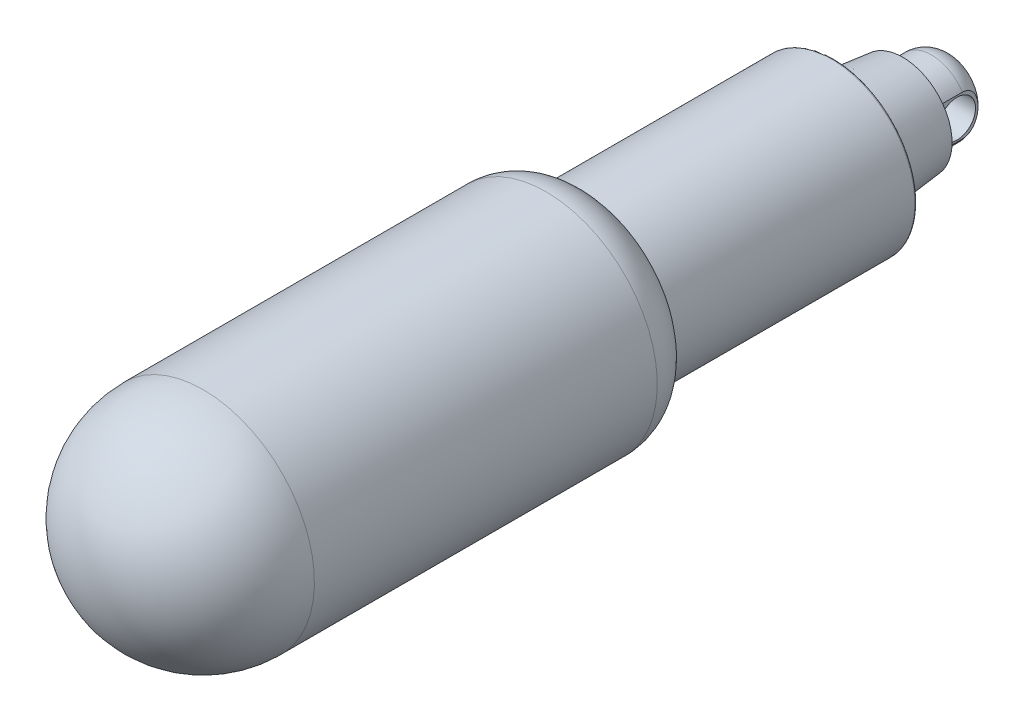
ISO-10303-21;
HEADER;
FILE_DESCRIPTION(('STEP AP214'),'2;1');
FILE_NAME('part.step','',(''),(''),'','','');
FILE_SCHEMA(('AUTOMOTIVE_DESIGN { 1 0 10303 214 1 1 1 1 }'));
ENDSEC;
DATA;
#1=APPLICATION_CONTEXT('core data for automotive mechanical design processes');
#2=APPLICATION_PROTOCOL_DEFINITION('international standard','automotive_design',2000,#1);
#3=PRODUCT_CONTEXT('',#1,'mechanical');
#4=PRODUCT('Part','Part','',(#3));
#5=PRODUCT_RELATED_PRODUCT_CATEGORY('part','',(#4));
#6=PRODUCT_DEFINITION_FORMATION('','',#4);
#7=PRODUCT_DEFINITION_CONTEXT('part definition',#1,'design');
#8=PRODUCT_DEFINITION('design','',#6,#7);
#9=PRODUCT_DEFINITION_SHAPE('','',#8);
#10=(LENGTH_UNIT() NAMED_UNIT(*) SI_UNIT(.MILLI.,.METRE.));
#11=(NAMED_UNIT(*) PLANE_ANGLE_UNIT() SI_UNIT($,.RADIAN.));
#12=(NAMED_UNIT(*) SI_UNIT($,.STERADIAN.) SOLID_ANGLE_UNIT());
#13=UNCERTAINTY_MEASURE_WITH_UNIT(LENGTH_MEASURE(1.E-05),#10,'distance_accuracy_value','');
#14=(GEOMETRIC_REPRESENTATION_CONTEXT(3) GLOBAL_UNCERTAINTY_ASSIGNED_CONTEXT((#13)) GLOBAL_UNIT_ASSIGNED_CONTEXT((#10,
#11,#12)) REPRESENTATION_CONTEXT('',''));
#15=CARTESIAN_POINT('',(0.,0.,0.));
#16=DIRECTION('',(0.,0.,1.));
#17=DIRECTION('',(1.,0.,0.));
#18=AXIS2_PLACEMENT_3D('',#15,#16,#17);
#19=CARTESIAN_POINT('',(0.,-0.75,-3.0833333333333));
#20=DIRECTION('',(0.,0.,-1.));
#21=DIRECTION('',(0.,1.,0.));
#22=AXIS2_PLACEMENT_3D('',#19,#20,#21);
#23=PLANE('',#22);
#24=CARTESIAN_POINT('',(0.,0.,-3.0833333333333));
#25=DIRECTION('',(0.,0.,1.));
#26=DIRECTION('',(-1.,0.,0.));
#27=AXIS2_PLACEMENT_3D('',#24,#25,#26);
#28=CIRCLE('',#27,1.5);
#29=CARTESIAN_POINT('',(-1.5,0.,-3.0833333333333));
#30=VERTEX_POINT('',#29);
#31=CARTESIAN_POINT('',(0.,-1.5,-3.0833333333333));
#32=VERTEX_POINT('',#31);
#33=EDGE_CURVE('E70',#30,#32,#28,.T.);
#34=ORIENTED_EDGE('',*,*,#33,.F.);
#35=CARTESIAN_POINT('',(0.,0.,-3.0833333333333));
#36=DIRECTION('',(0.,0.,1.));
#37=DIRECTION('',(1.,0.,0.));
#38=AXIS2_PLACEMENT_3D('',#35,#36,#37);
#39=CIRCLE('',#38,1.49999999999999);
#40=CARTESIAN_POINT('',(1.5,0.,-3.0833333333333));
#41=VERTEX_POINT('',#40);
#42=EDGE_CURVE('E484',#41,#30,#39,.T.);
#43=ORIENTED_EDGE('',*,*,#42,.F.);
#44=CARTESIAN_POINT('',(0.,0.,-3.0833333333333));
#45=DIRECTION('',(0.,0.,1.));
#46=DIRECTION('',(0.,-1.,0.));
#47=AXIS2_PLACEMENT_3D('',#44,#45,#46);
#48=CIRCLE('',#47,1.49999999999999);
#49=EDGE_CURVE('E77',#32,#41,#48,.T.);
#50=ORIENTED_EDGE('',*,*,#49,.F.);
#51=EDGE_LOOP('',(#34,#43,#50));
#52=FACE_BOUND('',#51,.T.);
#53=ADVANCED_FACE('F14',(#52),#23,.T.);
#54=CARTESIAN_POINT('',(-12.,0.,0.));
#55=DIRECTION('',(-1.,0.,0.));
#56=DIRECTION('',(0.,-1.,0.));
#57=AXIS2_PLACEMENT_3D('',#54,#55,#56);
#58=CYLINDRICAL_SURFACE('',#57,2.);
#59=CARTESIAN_POINT('',(-3.35,0.,0.));
#60=DIRECTION('',(-1.,0.,0.));
#61=DIRECTION('',(0.,-1.,0.));
#62=AXIS2_PLACEMENT_3D('',#59,#60,#61);
#63=CIRCLE('',#62,2.);
#64=CARTESIAN_POINT('',(-3.35,-2.,0.));
#65=VERTEX_POINT('',#64);
#66=EDGE_CURVE('E230',#65,#65,#63,.T.);
#67=ORIENTED_EDGE('',*,*,#66,.T.);
#68=EDGE_LOOP('',(#67));
#69=FACE_BOUND('',#68,.T.);
#70=CARTESIAN_POINT('',(3.35,0.,0.));
#71=DIRECTION('',(-1.,0.,0.));
#72=DIRECTION('',(0.,-1.,0.));
#73=AXIS2_PLACEMENT_3D('',#70,#71,#72);
#74=CIRCLE('',#73,2.);
#75=CARTESIAN_POINT('',(3.35,-2.,0.));
#76=VERTEX_POINT('',#75);
#77=EDGE_CURVE('E480',#76,#76,#74,.F.);
#78=ORIENTED_EDGE('',*,*,#77,.T.);
#79=EDGE_LOOP('',(#78));
#80=FACE_BOUND('',#79,.T.);
#81=ADVANCED_FACE('F251',(#69,#80),#58,.F.);
#82=CARTESIAN_POINT('',(1.5,0.,-0.583333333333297));
#83=DIRECTION('',(0.,1.,0.));
#84=DIRECTION('',(1.,0.,0.));
#85=AXIS2_PLACEMENT_3D('',#82,#83,#84);
#86=CIRCLE('',#85,2.5);
#87=TRIMMED_CURVE('',#86,(PARAMETER_VALUE(-2.21429743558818)),
(PARAMETER_VALUE(2.21429743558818)),.T.,.PARAMETER.);
#88=CARTESIAN_POINT('',(0.,0.,-0.583333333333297));
#89=DIRECTION('',(0.,0.,1.));
#90=AXIS1_PLACEMENT('',#88,#89);
#91=SURFACE_OF_REVOLUTION('',#87,#90);
#92=ORIENTED_EDGE('',*,*,#49,.T.);
#93=ORIENTED_EDGE('',*,*,#42,.T.);
#94=ORIENTED_EDGE('',*,*,#33,.T.);
#95=EDGE_LOOP('',(#92,#93,#94));
#96=FACE_BOUND('',#95,.T.);
#97=CARTESIAN_POINT('',(0.,0.,-0.583333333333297));
#98=DIRECTION('',(0.,0.,-1.));
#99=DIRECTION('',(-1.,0.,0.));
#100=AXIS2_PLACEMENT_3D('',#97,#98,#99);
#101=CIRCLE('',#100,4.);
#102=CARTESIAN_POINT('',(3.35,2.1857492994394,-0.583333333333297));
#103=VERTEX_POINT('',#102);
#104=CARTESIAN_POINT('',(-3.35,2.1857492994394,-0.583333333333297));
#105=VERTEX_POINT('',#104);
#106=EDGE_CURVE('E234',#103,#105,#101,.F.);
#107=ORIENTED_EDGE('',*,*,#106,.F.);
#108=CARTESIAN_POINT('',(3.35,2.1857492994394,-0.583333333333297));
#109=CARTESIAN_POINT('',(3.35,2.18576028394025,-0.626621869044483));
#110=CARTESIAN_POINT('',(3.35,2.18369205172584,-0.669904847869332));
#111=CARTESIAN_POINT('',(3.35,2.17548145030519,-0.756062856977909));
#112=CARTESIAN_POINT('',(3.35,2.16934099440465,-0.798938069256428));
#113=CARTESIAN_POINT('',(3.35,2.15311828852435,-0.883673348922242));
#114=CARTESIAN_POINT('',(3.35,2.14305960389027,-0.925537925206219));
#115=CARTESIAN_POINT('',(3.35,2.11916419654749,-1.00816304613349));
#116=CARTESIAN_POINT('',(3.35,2.10532724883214,-1.04892352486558));
#117=CARTESIAN_POINT('',(3.35,2.05847103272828,-1.16896572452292));
#118=CARTESIAN_POINT('',(3.35,2.02006681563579,-1.24620925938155));
#119=CARTESIAN_POINT('',(3.35,1.93091451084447,-1.39317323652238));
#120=CARTESIAN_POINT('',(3.35,1.88015420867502,-1.46288613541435));
#121=CARTESIAN_POINT('',(3.35,1.76841235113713,-1.59378533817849));
#122=CARTESIAN_POINT('',(3.35,1.70740791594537,-1.65495198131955));
#123=CARTESIAN_POINT('',(3.35,1.57744893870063,-1.76809437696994));
#124=CARTESIAN_POINT('',(3.35,1.50849083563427,-1.82006598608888));
#125=CARTESIAN_POINT('',(3.35,1.32943396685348,-1.93793497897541));
#126=CARTESIAN_POINT('',(3.35,1.21566388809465,-1.99827482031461));
#127=CARTESIAN_POINT('',(3.35,0.979888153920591,-2.09976246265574));
#128=CARTESIAN_POINT('',(3.35,0.857869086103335,-2.14087810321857));
#129=CARTESIAN_POINT('',(3.35,0.614005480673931,-2.20418543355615));
#130=CARTESIAN_POINT('',(3.35,0.49232732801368,-2.22703131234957));
#131=CARTESIAN_POINT('',(3.35,0.247108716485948,-2.25736255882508));
#132=CARTESIAN_POINT('',(3.35,0.123567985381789,-2.26484565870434));
#133=CARTESIAN_POINT('',(3.35,-0.151714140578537,-2.26485645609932));
#134=CARTESIAN_POINT('',(3.35,-0.303469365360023,-2.25358938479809));
#135=CARTESIAN_POINT('',(3.35,-0.603503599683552,-2.20762676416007));
#136=CARTESIAN_POINT('',(3.35,-0.75178337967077,-2.17293645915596));
#137=CARTESIAN_POINT('',(3.35,-1.00980675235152,-2.08787304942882));
#138=CARTESIAN_POINT('',(3.35000000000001,-1.12112273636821,-2.04229895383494));
#139=CARTESIAN_POINT('',(3.34999999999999,-1.3350039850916,-1.93389932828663));
#140=CARTESIAN_POINT('',(3.34999999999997,-1.43758419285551,-1.8711040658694));
#141=CARTESIAN_POINT('',(3.35000000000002,-1.60965976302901,-1.74245197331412));
#142=CARTESIAN_POINT('',(3.35000000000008,-1.68161510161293,-1.67989817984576));
#143=CARTESIAN_POINT('',(3.34999999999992,-1.81438800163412,-1.54382131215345));
#144=CARTESIAN_POINT('',(3.34999999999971,-1.87520703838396,-1.47029969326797));
#145=CARTESIAN_POINT('',(3.34999999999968,-1.98313078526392,-1.31268767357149));
#146=CARTESIAN_POINT('',(3.34999999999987,-2.03011506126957,-1.22851308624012));
#147=CARTESIAN_POINT('',(3.35000000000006,-2.08749187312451,-1.09673781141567));
#148=CARTESIAN_POINT('',(3.35000000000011,-2.10443190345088,-1.05190437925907));
#149=CARTESIAN_POINT('',(3.34999999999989,-2.1336965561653,-0.960763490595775));
#150=CARTESIAN_POINT('',(3.34999999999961,-2.14602369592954,-0.914456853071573));
#151=CARTESIAN_POINT('',(3.34999999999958,-2.16580487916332,-0.820926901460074));
#152=CARTESIAN_POINT('',(3.34999999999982,-2.17327017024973,-0.773705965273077));
#153=CARTESIAN_POINT('',(3.35000000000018,-2.18324911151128,-0.678770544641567));
#154=CARTESIAN_POINT('',(3.35000000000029,-2.18576541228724,-0.631056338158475));
#155=CARTESIAN_POINT('',(3.35,-2.1857492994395,-0.583333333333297));
#156=B_SPLINE_CURVE_WITH_KNOTS('',3,(#108,#109,#110,#111,#112,#113,#114,#115,#116,#117,#118,
#119,#120,#121,#122,#123,#124,#125,#126,#127,#128,#129,#130,#131,#132,#133,#134,#135,#136,#137,
#138,#139,#140,#141,#142,#143,#144,#145,#146,#147,#148,#149,#150,#151,#152,#153,#154,#155),
.UNSPECIFIED.,.F.,.F.,(4,2,2,2,2,2,2,2,2,2,2,2,2,2,2,2,2,2,2,2,2,2,2,4),(0.,0.129807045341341,
0.259553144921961,0.388530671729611,0.5175158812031,0.774880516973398,1.0325006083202,
1.29070392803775,1.54902330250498,1.93323807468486,2.31809332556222,2.68845915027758,
3.05887964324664,3.51367403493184,3.96836663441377,4.32793816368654,4.68688172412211,
4.97178900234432,5.25665850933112,5.54393913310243,5.68751574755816,5.83101389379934,
5.97417887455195,6.11726715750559),.UNSPECIFIED.);
#157=CARTESIAN_POINT('',(3.35,-2.1857492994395,-0.583333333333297));
#158=VERTEX_POINT('',#157);
#159=EDGE_CURVE('E62',#103,#158,#156,.T.);
#160=ORIENTED_EDGE('',*,*,#159,.T.);
#161=CARTESIAN_POINT('',(0.,0.,-0.583333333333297));
#162=DIRECTION('',(0.,0.,-1.));
#163=DIRECTION('',(-1.,0.,0.));
#164=AXIS2_PLACEMENT_3D('',#161,#162,#163);
#165=CIRCLE('',#164,4.);
#166=CARTESIAN_POINT('',(-3.35,-2.1857492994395,-0.583333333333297));
#167=VERTEX_POINT('',#166);
#168=EDGE_CURVE('E482',#167,#158,#165,.F.);
#169=ORIENTED_EDGE('',*,*,#168,.F.);
#170=CARTESIAN_POINT('',(-3.35,-2.1857492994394,-0.583333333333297));
#171=CARTESIAN_POINT('',(-3.35,-2.18576028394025,-0.626621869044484));
#172=CARTESIAN_POINT('',(-3.35,-2.18369205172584,-0.669904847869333));
#173=CARTESIAN_POINT('',(-3.35,-2.17548145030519,-0.75606285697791));
#174=CARTESIAN_POINT('',(-3.35,-2.16934099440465,-0.798938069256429));
#175=CARTESIAN_POINT('',(-3.35,-2.15311828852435,-0.883673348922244));
#176=CARTESIAN_POINT('',(-3.35,-2.14305960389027,-0.92553792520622));
#177=CARTESIAN_POINT('',(-3.35,-2.11916419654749,-1.00816304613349));
#178=CARTESIAN_POINT('',(-3.35,-2.10532724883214,-1.04892352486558));
#179=CARTESIAN_POINT('',(-3.35,-2.05847103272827,-1.16896572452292));
#180=CARTESIAN_POINT('',(-3.35,-2.02006681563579,-1.24620925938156));
#181=CARTESIAN_POINT('',(-3.35,-1.93091451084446,-1.39317323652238));
#182=CARTESIAN_POINT('',(-3.35,-1.88015420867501,-1.46288613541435));
#183=CARTESIAN_POINT('',(-3.35,-1.76841235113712,-1.59378533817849));
#184=CARTESIAN_POINT('',(-3.35,-1.70740791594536,-1.65495198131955));
#185=CARTESIAN_POINT('',(-3.35,-1.57744893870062,-1.76809437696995));
#186=CARTESIAN_POINT('',(-3.35,-1.50849083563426,-1.82006598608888));
#187=CARTESIAN_POINT('',(-3.35,-1.32943396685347,-1.93793497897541));
#188=CARTESIAN_POINT('',(-3.35,-1.21566388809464,-1.99827482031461));
#189=CARTESIAN_POINT('',(-3.35,-0.979888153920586,-2.09976246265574));
#190=CARTESIAN_POINT('',(-3.35,-0.857869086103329,-2.14087810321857));
#191=CARTESIAN_POINT('',(-3.35,-0.614005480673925,-2.20418543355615));
#192=CARTESIAN_POINT('',(-3.35,-0.492327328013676,-2.22703131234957));
#193=CARTESIAN_POINT('',(-3.35,-0.247108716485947,-2.25736255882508));
#194=CARTESIAN_POINT('',(-3.35,-0.123567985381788,-2.26484565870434));
#195=CARTESIAN_POINT('',(-3.35,0.151714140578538,-2.26485645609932));
#196=CARTESIAN_POINT('',(-3.35,0.303469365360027,-2.25358938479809));
#197=CARTESIAN_POINT('',(-3.35,0.603503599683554,-2.20762676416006));
#198=CARTESIAN_POINT('',(-3.35,0.751783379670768,-2.17293645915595));
#199=CARTESIAN_POINT('',(-3.35,1.00980675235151,-2.08787304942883));
#200=CARTESIAN_POINT('',(-3.35000000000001,1.1211227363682,-2.04229895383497));
#201=CARTESIAN_POINT('',(-3.34999999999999,1.33500398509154,-1.93389932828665));
#202=CARTESIAN_POINT('',(-3.34999999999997,1.43758419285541,-1.87110406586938));
#203=CARTESIAN_POINT('',(-3.35000000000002,1.60965976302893,-1.74245197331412));
#204=CARTESIAN_POINT('',(-3.35000000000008,1.68161510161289,-1.67989817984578));
#205=CARTESIAN_POINT('',(-3.34999999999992,1.81438800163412,-1.54382131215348));
#206=CARTESIAN_POINT('',(-3.34999999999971,1.87520703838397,-1.47029969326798));
#207=CARTESIAN_POINT('',(-3.34999999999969,1.98313078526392,-1.31268767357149));
#208=CARTESIAN_POINT('',(-3.34999999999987,2.03011506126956,-1.22851308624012));
#209=CARTESIAN_POINT('',(-3.35000000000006,2.0874918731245,-1.09673781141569));
#210=CARTESIAN_POINT('',(-3.35000000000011,2.10443190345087,-1.05190437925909));
#211=CARTESIAN_POINT('',(-3.34999999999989,2.13369655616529,-0.96076349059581));
#212=CARTESIAN_POINT('',(-3.34999999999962,2.14602369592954,-0.914456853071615));
#213=CARTESIAN_POINT('',(-3.34999999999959,2.16580487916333,-0.820926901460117));
#214=CARTESIAN_POINT('',(-3.34999999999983,2.17327017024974,-0.773705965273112));
#215=CARTESIAN_POINT('',(-3.35000000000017,2.18324911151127,-0.678770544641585));
#216=CARTESIAN_POINT('',(-3.35000000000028,2.18576541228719,-0.631056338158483));
#217=CARTESIAN_POINT('',(-3.35,2.1857492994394,-0.583333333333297));
#218=B_SPLINE_CURVE_WITH_KNOTS('',3,(#170,#171,#172,#173,#174,#175,#176,#177,#178,#179,#180,
#181,#182,#183,#184,#185,#186,#187,#188,#189,#190,#191,#192,#193,#194,#195,#196,#197,#198,#199,
#200,#201,#202,#203,#204,#205,#206,#207,#208,#209,#210,#211,#212,#213,#214,#215,#216,#217),
.UNSPECIFIED.,.F.,.F.,(4,2,2,2,2,2,2,2,2,2,2,2,2,2,2,2,2,2,2,2,2,2,2,4),(0.,0.129807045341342,
0.259553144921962,0.388530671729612,0.517515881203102,0.774880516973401,1.03250060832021,
1.29070392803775,1.54902330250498,1.93323807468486,2.31809332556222,2.68845915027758,
3.05887964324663,3.51367403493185,3.96836663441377,4.32793816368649,4.68688172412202,
4.97178900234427,5.25665850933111,5.5439391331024,5.68751574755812,5.83101389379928,
5.97417887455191,6.11726715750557),.UNSPECIFIED.);
#219=EDGE_CURVE('E226',#167,#105,#218,.T.);
#220=ORIENTED_EDGE('',*,*,#219,.T.);
#221=EDGE_LOOP('',(#107,#160,#169,#220));
#222=FACE_BOUND('',#221,.T.);
#223=ADVANCED_FACE('F245',(#96,#222),#91,.F.);
#224=CARTESIAN_POINT('',(0.,0.,0.958333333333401));
#225=DIRECTION('',(0.,0.,-1.));
#226=DIRECTION('',(-1.,0.,0.));
#227=AXIS2_PLACEMENT_3D('',#224,#225,#226);
#228=CYLINDRICAL_SURFACE('',#227,4.);
#229=DIRECTION('',(0.,0.,1.));
#230=VECTOR('',#229,1.);
#231=CARTESIAN_POINT('',(3.35,-2.1857492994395,-2.5833333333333));
#232=LINE('',#231,#230);
#233=CARTESIAN_POINT('',(3.35,-2.1857492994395,2.5));
#234=VERTEX_POINT('',#233);
#235=EDGE_CURVE('E235',#158,#234,#232,.T.);
#236=ORIENTED_EDGE('',*,*,#235,.T.);
#237=CARTESIAN_POINT('',(0.,0.,2.5));
#238=DIRECTION('',(0.,0.,-1.));
#239=DIRECTION('',(-1.,0.,0.));
#240=AXIS2_PLACEMENT_3D('',#237,#238,#239);
#241=CIRCLE('',#240,4.);
#242=CARTESIAN_POINT('',(-3.35,-2.1857492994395,2.5));
#243=VERTEX_POINT('',#242);
#244=EDGE_CURVE('E223',#243,#234,#241,.F.);
#245=ORIENTED_EDGE('',*,*,#244,.F.);
#246=DIRECTION('',(0.,0.,-1.));
#247=VECTOR('',#246,1.);
#248=CARTESIAN_POINT('',(-3.35,-2.1857492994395,2.5));
#249=LINE('',#248,#247);
#250=EDGE_CURVE('E227',#243,#167,#249,.T.);
#251=ORIENTED_EDGE('',*,*,#250,.T.);
#252=ORIENTED_EDGE('',*,*,#168,.T.);
#253=EDGE_LOOP('',(#236,#245,#251,#252));
#254=FACE_BOUND('',#253,.T.);
#255=ADVANCED_FACE('F250',(#254),#228,.T.);
#256=CARTESIAN_POINT('',(3.35,12.,-2.5833333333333));
#257=DIRECTION('',(-1.,0.,0.));
#258=DIRECTION('',(0.,0.,1.));
#259=AXIS2_PLACEMENT_3D('',#256,#257,#258);
#260=PLANE('',#259);
#261=ORIENTED_EDGE('',*,*,#159,.F.);
#262=DIRECTION('',(0.,0.,-1.));
#263=VECTOR('',#262,1.);
#264=CARTESIAN_POINT('',(3.35,2.1857492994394,0.958333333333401));
#265=LINE('',#264,#263);
#266=CARTESIAN_POINT('',(3.35,2.1857492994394,2.5));
#267=VERTEX_POINT('',#266);
#268=EDGE_CURVE('E231',#267,#103,#265,.T.);
#269=ORIENTED_EDGE('',*,*,#268,.F.);
#270=DIRECTION('',(0.,1.,0.));
#271=VECTOR('',#270,1.);
#272=CARTESIAN_POINT('',(3.35,-4.65841123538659,2.5));
#273=LINE('',#272,#271);
#274=EDGE_CURVE('E220',#234,#267,#273,.T.);
#275=ORIENTED_EDGE('',*,*,#274,.F.);
#276=ORIENTED_EDGE('',*,*,#235,.F.);
#277=EDGE_LOOP('',(#261,#269,#275,#276));
#278=FACE_BOUND('',#277,.T.);
#279=ORIENTED_EDGE('',*,*,#77,.F.);
#280=EDGE_LOOP('',(#279));
#281=FACE_BOUND('',#280,.T.);
#282=ADVANCED_FACE('F428',(#278,#281),#260,.F.);
#283=CARTESIAN_POINT('',(0.,0.,0.958333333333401));
#284=DIRECTION('',(0.,0.,-1.));
#285=DIRECTION('',(-1.,0.,0.));
#286=AXIS2_PLACEMENT_3D('',#283,#284,#285);
#287=CYLINDRICAL_SURFACE('',#286,4.);
#288=DIRECTION('',(0.,0.,-1.));
#289=VECTOR('',#288,1.);
#290=CARTESIAN_POINT('',(-3.35,2.1857492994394,2.5));
#291=LINE('',#290,#289);
#292=CARTESIAN_POINT('',(-3.35,2.1857492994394,2.5));
#293=VERTEX_POINT('',#292);
#294=EDGE_CURVE('E224',#105,#293,#291,.F.);
#295=ORIENTED_EDGE('',*,*,#294,.T.);
#296=CARTESIAN_POINT('',(0.,0.,2.5));
#297=DIRECTION('',(0.,0.,-1.));
#298=DIRECTION('',(-1.,0.,0.));
#299=AXIS2_PLACEMENT_3D('',#296,#297,#298);
#300=CIRCLE('',#299,4.);
#301=EDGE_CURVE('E219',#267,#293,#300,.F.);
#302=ORIENTED_EDGE('',*,*,#301,.F.);
#303=ORIENTED_EDGE('',*,*,#268,.T.);
#304=ORIENTED_EDGE('',*,*,#106,.T.);
#305=EDGE_LOOP('',(#295,#302,#303,#304));
#306=FACE_BOUND('',#305,.T.);
#307=ADVANCED_FACE('F421',(#306),#287,.T.);
#308=CARTESIAN_POINT('',(-3.35,12.,2.5));
#309=DIRECTION('',(1.,0.,0.));
#310=DIRECTION('',(0.,0.,-1.));
#311=AXIS2_PLACEMENT_3D('',#308,#309,#310);
#312=PLANE('',#311);
#313=ORIENTED_EDGE('',*,*,#219,.F.);
#314=ORIENTED_EDGE('',*,*,#250,.F.);
#315=DIRECTION('',(0.,1.,0.));
#316=VECTOR('',#315,1.);
#317=CARTESIAN_POINT('',(-3.35,-4.65841123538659,2.5));
#318=LINE('',#317,#316);
#319=EDGE_CURVE('E210',#293,#243,#318,.F.);
#320=ORIENTED_EDGE('',*,*,#319,.F.);
#321=ORIENTED_EDGE('',*,*,#294,.F.);
#322=EDGE_LOOP('',(#313,#314,#320,#321));
#323=FACE_BOUND('',#322,.T.);
#324=ORIENTED_EDGE('',*,*,#66,.F.);
#325=EDGE_LOOP('',(#324));
#326=FACE_BOUND('',#325,.T.);
#327=ADVANCED_FACE('F413',(#323,#326),#312,.F.);
#328=CARTESIAN_POINT('',(0.,-4.65841123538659,2.5));
#329=DIRECTION('',(0.,0.,-1.));
#330=DIRECTION('',(-1.,0.,0.));
#331=AXIS2_PLACEMENT_3D('',#328,#329,#330);
#332=PLANE('',#331);
#333=ORIENTED_EDGE('',*,*,#301,.T.);
#334=ORIENTED_EDGE('',*,*,#319,.T.);
#335=ORIENTED_EDGE('',*,*,#244,.T.);
#336=ORIENTED_EDGE('',*,*,#274,.T.);
#337=EDGE_LOOP('',(#333,#334,#335,#336));
#338=FACE_BOUND('',#337,.T.);
#339=CARTESIAN_POINT('',(0.,0.,2.5000000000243));
#340=DIRECTION('',(0.,0.,1.));
#341=DIRECTION('',(1.,0.,0.));
#342=AXIS2_PLACEMENT_3D('',#339,#340,#341);
#343=CIRCLE('',#342,5.31682247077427);
#344=CARTESIAN_POINT('',(5.31682247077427,0.,2.5000000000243));
#345=VERTEX_POINT('',#344);
#346=EDGE_CURVE('E205',#345,#345,#343,.T.);
#347=ORIENTED_EDGE('',*,*,#346,.F.);
#348=EDGE_LOOP('',(#347));
#349=FACE_BOUND('',#348,.T.);
#350=ADVANCED_FACE('F312',(#338,#349),#332,.T.);
#351=CARTESIAN_POINT('',(0.,0.,8.64181138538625));
#352=DIRECTION('',(0.,0.,1.));
#353=DIRECTION('',(1.,0.,0.));
#354=AXIS2_PLACEMENT_3D('',#351,#352,#353);
#355=CONICAL_SURFACE('',#354,5.96235285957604,0.104719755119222);
#356=CARTESIAN_POINT('',(0.,0.,8.64181138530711));
#357=DIRECTION('',(0.,0.,1.));
#358=DIRECTION('',(1.,0.,0.));
#359=AXIS2_PLACEMENT_3D('',#356,#357,#358);
#360=CIRCLE('',#359,5.96235285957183);
#361=CARTESIAN_POINT('',(5.96235285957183,0.,8.64181138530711));
#362=VERTEX_POINT('',#361);
#363=EDGE_CURVE('E203',#362,#362,#360,.F.);
#364=ORIENTED_EDGE('',*,*,#363,.T.);
#365=EDGE_LOOP('',(#364));
#366=FACE_BOUND('',#365,.T.);
#367=ORIENTED_EDGE('',*,*,#346,.T.);
#368=EDGE_LOOP('',(#367));
#369=FACE_BOUND('',#368,.T.);
#370=ADVANCED_FACE('F305',(#366,#369),#355,.T.);
#371=CARTESIAN_POINT('',(0.,0.,8.6));
#372=DIRECTION('',(0.,0.,1.));
#373=DIRECTION('',(1.,0.,0.));
#374=AXIS2_PLACEMENT_3D('',#371,#372,#373);
#375=TOROIDAL_SURFACE('',#374,6.36016161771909,0.399999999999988);
#376=ORIENTED_EDGE('',*,*,#363,.F.);
#377=EDGE_LOOP('',(#376));
#378=FACE_BOUND('',#377,.T.);
#379=CARTESIAN_POINT('',(0.,0.,8.99999999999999));
#380=DIRECTION('',(0.,0.,-1.));
#381=DIRECTION('',(-1.,0.,0.));
#382=AXIS2_PLACEMENT_3D('',#379,#380,#381);
#383=CIRCLE('',#382,6.36016161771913);
#384=CARTESIAN_POINT('',(6.3601616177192,0.,9.));
#385=VERTEX_POINT('',#384);
#386=CARTESIAN_POINT('',(-6.36016161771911,0.,9.));
#387=VERTEX_POINT('',#386);
#388=EDGE_CURVE('E197',#385,#387,#383,.F.);
#389=ORIENTED_EDGE('',*,*,#388,.F.);
#390=CARTESIAN_POINT('',(0.,0.,8.99999999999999));
#391=DIRECTION('',(0.,0.,-1.));
#392=DIRECTION('',(1.,0.,0.));
#393=AXIS2_PLACEMENT_3D('',#390,#391,#392);
#394=CIRCLE('',#393,6.36016161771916);
#395=CARTESIAN_POINT('',(0.,-6.3601616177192,9.));
#396=VERTEX_POINT('',#395);
#397=EDGE_CURVE('E164',#396,#385,#394,.F.);
#398=ORIENTED_EDGE('',*,*,#397,.F.);
#399=CARTESIAN_POINT('',(0.,0.,8.99999999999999));
#400=DIRECTION('',(0.,0.,-1.));
#401=DIRECTION('',(0.,-1.,0.));
#402=AXIS2_PLACEMENT_3D('',#399,#400,#401);
#403=CIRCLE('',#402,6.36016161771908);
#404=EDGE_CURVE('E195',#387,#396,#403,.F.);
#405=ORIENTED_EDGE('',*,*,#404,.F.);
#406=EDGE_LOOP('',(#389,#398,#405));
#407=FACE_BOUND('',#406,.T.);
#408=ADVANCED_FACE('F178',(#378,#407),#375,.F.);
#409=CARTESIAN_POINT('',(0.,-6.75508080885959,9.));
#410=DIRECTION('',(0.,0.,-1.));
#411=DIRECTION('',(-1.,0.,0.));
#412=AXIS2_PLACEMENT_3D('',#409,#410,#411);
#413=PLANE('',#412);
#414=ORIENTED_EDGE('',*,*,#388,.T.);
#415=ORIENTED_EDGE('',*,*,#404,.T.);
#416=ORIENTED_EDGE('',*,*,#397,.T.);
#417=EDGE_LOOP('',(#414,#415,#416));
#418=FACE_BOUND('',#417,.T.);
#419=CARTESIAN_POINT('',(0.,0.,9.));
#420=DIRECTION('',(0.,0.,-1.));
#421=DIRECTION('',(-1.,0.,0.));
#422=AXIS2_PLACEMENT_3D('',#419,#420,#421);
#423=CIRCLE('',#422,7.15);
#424=CARTESIAN_POINT('',(-7.15,0.,9.));
#425=VERTEX_POINT('',#424);
#426=EDGE_CURVE('E200',#425,#425,#423,.F.);
#427=ORIENTED_EDGE('',*,*,#426,.F.);
#428=EDGE_LOOP('',(#427));
#429=FACE_BOUND('',#428,.T.);
#430=ADVANCED_FACE('F169',(#418,#429),#413,.T.);
#431=CARTESIAN_POINT('',(0.,0.,9.5));
#432=DIRECTION('',(0.,0.,-1.));
#433=DIRECTION('',(-1.,0.,0.));
#434=AXIS2_PLACEMENT_3D('',#431,#432,#433);
#435=CYLINDRICAL_SURFACE('',#434,7.15);
#436=CARTESIAN_POINT('',(0.,0.,10.));
#437=DIRECTION('',(0.,0.,-1.));
#438=DIRECTION('',(-1.,0.,0.));
#439=AXIS2_PLACEMENT_3D('',#436,#437,#438);
#440=CIRCLE('',#439,7.15);
#441=CARTESIAN_POINT('',(-7.15,0.,10.));
#442=VERTEX_POINT('',#441);
#443=EDGE_CURVE('E104',#442,#442,#440,.F.);
#444=ORIENTED_EDGE('',*,*,#443,.F.);
#445=EDGE_LOOP('',(#444));
#446=FACE_BOUND('',#445,.T.);
#447=ORIENTED_EDGE('',*,*,#426,.T.);
#448=EDGE_LOOP('',(#447));
#449=FACE_BOUND('',#448,.T.);
#450=ADVANCED_FACE('F127',(#446,#449),#435,.T.);
#451=CARTESIAN_POINT('',(0.,-7.975,10.));
#452=DIRECTION('',(0.,0.,-1.));
#453=DIRECTION('',(-1.,0.,0.));
#454=AXIS2_PLACEMENT_3D('',#451,#452,#453);
#455=PLANE('',#454);
#456=ORIENTED_EDGE('',*,*,#443,.T.);
#457=EDGE_LOOP('',(#456));
#458=FACE_BOUND('',#457,.T.);
#459=CARTESIAN_POINT('',(0.,0.,10.));
#460=DIRECTION('',(0.,0.,1.));
#461=DIRECTION('',(-1.,0.,0.));
#462=AXIS2_PLACEMENT_3D('',#459,#460,#461);
#463=CIRCLE('',#462,8.8);
#464=CARTESIAN_POINT('',(-8.8,0.,10.));
#465=VERTEX_POINT('',#464);
#466=CARTESIAN_POINT('',(0.,-8.8,10.));
#467=VERTEX_POINT('',#466);
#468=EDGE_CURVE('E98',#465,#467,#463,.T.);
#469=ORIENTED_EDGE('',*,*,#468,.F.);
#470=CARTESIAN_POINT('',(0.,0.,10.));
#471=DIRECTION('',(0.,0.,1.));
#472=DIRECTION('',(1.,0.,0.));
#473=AXIS2_PLACEMENT_3D('',#470,#471,#472);
#474=CIRCLE('',#473,8.79999999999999);
#475=CARTESIAN_POINT('',(8.8,0.,10.));
#476=VERTEX_POINT('',#475);
#477=EDGE_CURVE('E94',#476,#465,#474,.T.);
#478=ORIENTED_EDGE('',*,*,#477,.F.);
#479=CARTESIAN_POINT('',(0.,0.,10.));
#480=DIRECTION('',(0.,0.,1.));
#481=DIRECTION('',(0.,-1.,0.));
#482=AXIS2_PLACEMENT_3D('',#479,#480,#481);
#483=CIRCLE('',#482,8.79999999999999);
#484=EDGE_CURVE('E100',#467,#476,#483,.T.);
#485=ORIENTED_EDGE('',*,*,#484,.F.);
#486=EDGE_LOOP('',(#469,#478,#485));
#487=FACE_BOUND('',#486,.T.);
#488=ADVANCED_FACE('F108',(#458,#487),#455,.T.);
#489=CARTESIAN_POINT('',(0.,0.,10.2));
#490=DIRECTION('',(0.,0.,1.));
#491=DIRECTION('',(1.,0.,0.));
#492=AXIS2_PLACEMENT_3D('',#489,#490,#491);
#493=TOROIDAL_SURFACE('',#492,8.8,0.2);
#494=CARTESIAN_POINT('',(0.,0.,10.2));
#495=DIRECTION('',(0.,0.,-1.));
#496=DIRECTION('',(-1.,0.,0.));
#497=AXIS2_PLACEMENT_3D('',#494,#495,#496);
#498=CIRCLE('',#497,9.);
#499=CARTESIAN_POINT('',(-9.,0.,10.2));
#500=VERTEX_POINT('',#499);
#501=EDGE_CURVE('E337',#500,#500,#498,.F.);
#502=ORIENTED_EDGE('',*,*,#501,.F.);
#503=EDGE_LOOP('',(#502));
#504=FACE_BOUND('',#503,.T.);
#505=ORIENTED_EDGE('',*,*,#468,.T.);
#506=ORIENTED_EDGE('',*,*,#484,.T.);
#507=ORIENTED_EDGE('',*,*,#477,.T.);
#508=EDGE_LOOP('',(#505,#506,#507));
#509=FACE_BOUND('',#508,.T.);
#510=ADVANCED_FACE('F97',(#504,#509),#493,.T.);
#511=CARTESIAN_POINT('',(0.,0.,23.3087121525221));
#512=DIRECTION('',(0.,0.,-1.));
#513=DIRECTION('',(-1.,0.,0.));
#514=AXIS2_PLACEMENT_3D('',#511,#512,#513);
#515=CYLINDRICAL_SURFACE('',#514,9.);
#516=CARTESIAN_POINT('',(0.,0.,36.4174243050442));
#517=DIRECTION('',(0.,0.,1.));
#518=DIRECTION('',(1.,0.,0.));
#519=AXIS2_PLACEMENT_3D('',#516,#517,#518);
#520=CIRCLE('',#519,9.);
#521=CARTESIAN_POINT('',(9.,0.,36.4174243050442));
#522=VERTEX_POINT('',#521);
#523=EDGE_CURVE('E335',#522,#522,#520,.T.);
#524=ORIENTED_EDGE('',*,*,#523,.F.);
#525=EDGE_LOOP('',(#524));
#526=FACE_BOUND('',#525,.T.);
#527=ORIENTED_EDGE('',*,*,#501,.T.);
#528=EDGE_LOOP('',(#527));
#529=FACE_BOUND('',#528,.T.);
#530=ADVANCED_FACE('F343',(#526,#529),#515,.T.);
#531=CARTESIAN_POINT('',(0.,0.,41.));
#532=DIRECTION('',(0.,0.,1.));
#533=DIRECTION('',(1.,0.,0.));
#534=AXIS2_PLACEMENT_3D('',#531,#532,#533);
#535=TOROIDAL_SURFACE('',#534,7.,5.);
#536=ORIENTED_EDGE('',*,*,#523,.T.);
#537=EDGE_LOOP('',(#536));
#538=FACE_BOUND('',#537,.T.);
#539=CARTESIAN_POINT('',(0.,0.,41.));
#540=DIRECTION('',(0.,0.,-1.));
#541=DIRECTION('',(-1.,0.,0.));
#542=AXIS2_PLACEMENT_3D('',#539,#540,#541);
#543=CIRCLE('',#542,12.);
#544=CARTESIAN_POINT('',(-12.,0.,41.));
#545=VERTEX_POINT('',#544);
#546=EDGE_CURVE('E26',#545,#545,#543,.F.);
#547=ORIENTED_EDGE('',*,*,#546,.F.);
#548=EDGE_LOOP('',(#547));
#549=FACE_BOUND('',#548,.T.);
#550=ADVANCED_FACE('F322',(#538,#549),#535,.T.);
#551=CARTESIAN_POINT('',(0.,0.,78.));
#552=DIRECTION('',(0.,0.,1.));
#553=DIRECTION('',(0.,1.,0.));
#554=AXIS2_PLACEMENT_3D('',#551,#552,#553);
#555=SPHERICAL_SURFACE('',#554,12.);
#556=CARTESIAN_POINT('',(0.,0.,90.));
#557=VERTEX_POINT('',#556);
#558=VERTEX_LOOP('',#557);
#559=FACE_BOUND('',#558,.T.);
#560=CARTESIAN_POINT('',(0.,0.,78.));
#561=DIRECTION('',(0.,0.,-1.));
#562=DIRECTION('',(-1.,0.,0.));
#563=AXIS2_PLACEMENT_3D('',#560,#561,#562);
#564=CIRCLE('',#563,12.);
#565=CARTESIAN_POINT('',(-12.,0.,78.));
#566=VERTEX_POINT('',#565);
#567=EDGE_CURVE('E9',#566,#566,#564,.T.);
#568=ORIENTED_EDGE('',*,*,#567,.F.);
#569=EDGE_LOOP('',(#568));
#570=FACE_BOUND('',#569,.T.);
#571=ADVANCED_FACE('F315',(#559,#570),#555,.T.);
#572=CARTESIAN_POINT('',(0.,0.,59.5));
#573=DIRECTION('',(0.,0.,-1.));
#574=DIRECTION('',(-1.,0.,0.));
#575=AXIS2_PLACEMENT_3D('',#572,#573,#574);
#576=CYLINDRICAL_SURFACE('',#575,12.);
#577=ORIENTED_EDGE('',*,*,#546,.T.);
#578=EDGE_LOOP('',(#577));
#579=FACE_BOUND('',#578,.T.);
#580=ORIENTED_EDGE('',*,*,#567,.T.);
#581=EDGE_LOOP('',(#580));
#582=FACE_BOUND('',#581,.T.);
#583=ADVANCED_FACE('F313',(#579,#582),#576,.T.);
#584=CLOSED_SHELL('',(#53,#81,#223,#255,#282,#307,#327,#350,#370,#408,#430,#450,#488,#510,#530,
#550,#571,#583));
#585=MANIFOLD_SOLID_BREP('B1',#584);
#586=ADVANCED_BREP_SHAPE_REPRESENTATION('',(#18,#585),#14);
#587=SHAPE_DEFINITION_REPRESENTATION(#9,#586);
ENDSEC;
END-ISO-10303-21;
